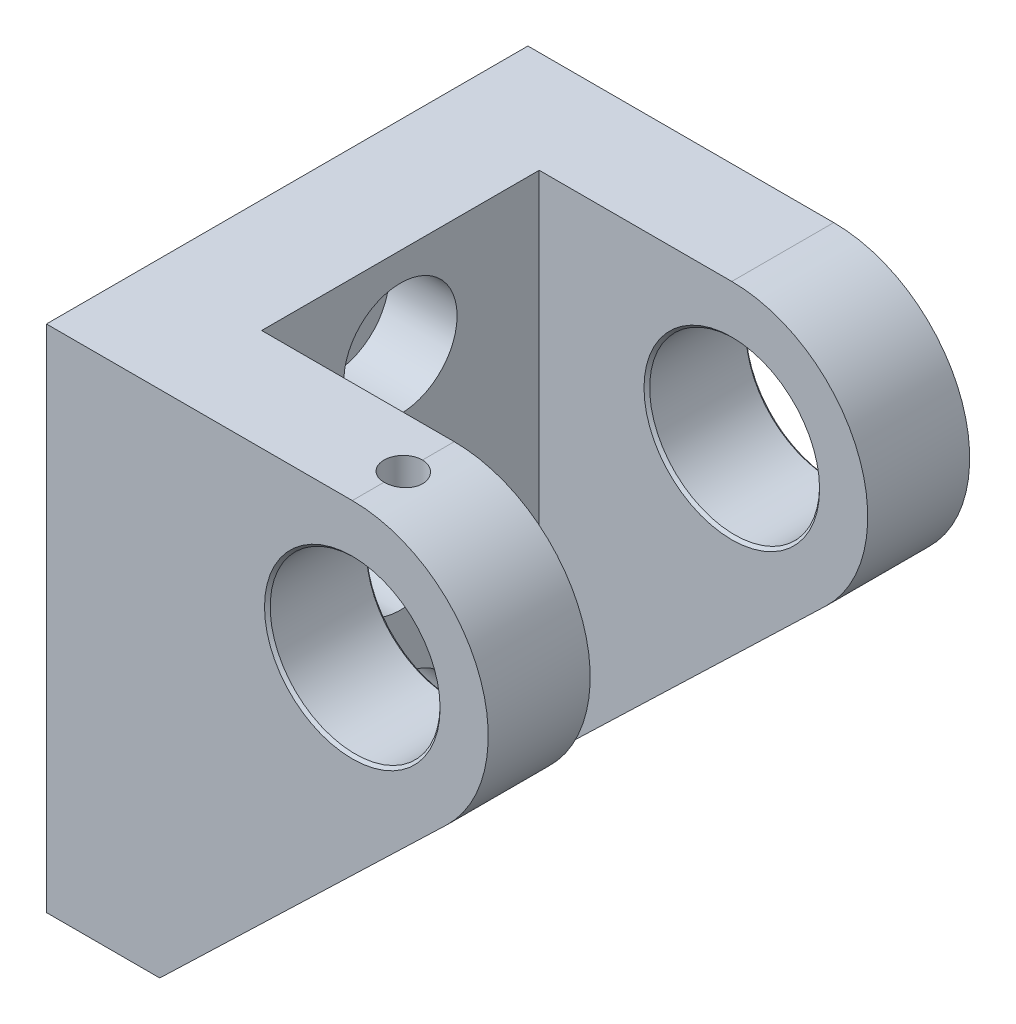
from build123d import *

# Parameters (mm, degrees)
ESTRUSIONE1_DEPTH                                    = 42.5
TAGLIO_ESTRUSIONE1_DEPTH                             = 24.5
SCHIZZO5_R                                           = 15
TAGLIO_ESTRUSIONE2_DEPTH                             = 121.403488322
M12_LAMATURA_PER_VITE_A_COPERTURA_CILIND_D           = 13
M12_LAMATURA_PER_VITE_A_COPERTURA_CILIND_CBORE_D     = 20
M12_LAMATURA_PER_VITE_A_COPERTURA_CILIND_CBORE_DEPTH = 12
M8_FORO_FILETTATO_PROFONDO1_REACH                    = 115.235
M8_FORO_FILETTATO_PROFONDO1_BORE_R                   = 3.4
F_8_0_8_FORO_DIAMETRALE1_D                           = 8
SMUSSO1_SIZE                                         = 0.5


with BuildPart() as part:
    # Schizzo1 → Estrusione1 (new, symmetric)
    with BuildSketch(Plane.XY):
        with BuildLine():
            Line((0, 24), (-54, 24))
            Line((-54, 24), (-54, -66))
            Line((-54, -66), (-34, -66))
            Line((-34, -66), (16.636895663, -17.297794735))
            ThreePointArc((16.636895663, -17.297794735), (22.261481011, 8.968080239), (0, 24))
        make_face()
    extrude(amount=ESTRUSIONE1_DEPTH, both=True)

    # Schizzo4 → Taglio-Estrusione1 (cut, symmetric)
    with BuildSketch(Plane.XY):
        with BuildLine():
            Line((0, 24), (-34, 24))
            Line((-34, 24), (-34, -66))
            Line((-34, -66), (16.636895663, -17.297794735))
            ThreePointArc((16.636895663, -17.297794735), (22.261481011, 8.968080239), (0, 24))
        make_face()
    extrude(amount=TAGLIO_ESTRUSIONE1_DEPTH, both=True, mode=Mode.SUBTRACT)

    # Schizzo5 → Taglio-Estrusione2 (cut, through all)
    with BuildSketch(Plane.XY.offset(42.5)):
        Circle(SCHIZZO5_R)
    extrude(amount=-TAGLIO_ESTRUSIONE2_DEPTH, mode=Mode.SUBTRACT)

    # M12 Lamatura per vite a copertura cilind (through all)
    with Locations(Plane(origin=(-34, 0, 0), x_dir=(0, 0, -1), z_dir=(1, 0, 0))):
        with Locations((0, 9), (0, -21), (0, -51)):
            CounterBoreHole(M12_LAMATURA_PER_VITE_A_COPERTURA_CILIND_D / 2, M12_LAMATURA_PER_VITE_A_COPERTURA_CILIND_CBORE_D / 2, M12_LAMATURA_PER_VITE_A_COPERTURA_CILIND_CBORE_DEPTH)

    # M8 Foro filettato profondo1 bore → M8 Foro filettato profondo1 (cut, up to next)
    with BuildSketch(Plane(origin=(0, 24, 0), x_dir=(-1, 0, 0), z_dir=(0, 1, 0)), mode=Mode.PRIVATE) as m8_foro_filettato_profondo1_sk1:
        with Locations((0, 33.5)):
            Circle(M8_FORO_FILETTATO_PROFONDO1_BORE_R)
    m8_foro_filettato_profondo1_tool1 = extrude(m8_foro_filettato_profondo1_sk1.sketch, amount=-M8_FORO_FILETTATO_PROFONDO1_REACH, mode=Mode.PRIVATE) & part.part
    add(m8_foro_filettato_profondo1_tool1.solids().sort_by_distance((0, 24, 33.5))[0], mode=Mode.SUBTRACT)

    # 8.0 _8_ Foro diametrale1 (through all)
    with Locations(Plane(origin=(-34, 0, 0), x_dir=(0, 0, -1), z_dir=(1, 0, 0))):
        with Locations((-15, -58)):
            Hole(F_8_0_8_FORO_DIAMETRALE1_D / 2)

    # Smusso1
    smusso1_edges = [part.edges().sort_by_distance(p)[0] for p in [
        (-15, 0, -24.5),
        (-15, 0, 24.5),
        (-15, 0, -42.5),
        (-15, 0, 42.5),
    ]]
    chamfer(smusso1_edges, length=SMUSSO1_SIZE)


solid = part.part
